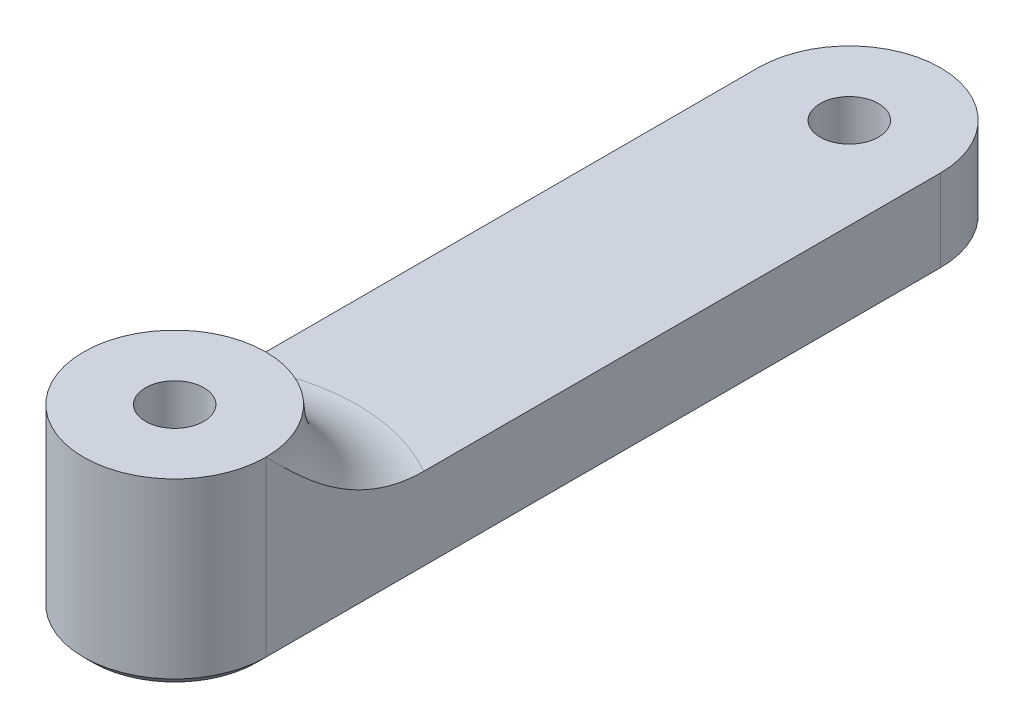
ISO-10303-21;
HEADER;
FILE_DESCRIPTION(('STEP AP214'),'2;1');
FILE_NAME('part.step','',(''),(''),'','','');
FILE_SCHEMA(('AUTOMOTIVE_DESIGN { 1 0 10303 214 1 1 1 1 }'));
ENDSEC;
DATA;
#1=APPLICATION_CONTEXT('core data for automotive mechanical design processes');
#2=APPLICATION_PROTOCOL_DEFINITION('international standard','automotive_design',2000,#1);
#3=PRODUCT_CONTEXT('',#1,'mechanical');
#4=PRODUCT('Part','Part','',(#3));
#5=PRODUCT_RELATED_PRODUCT_CATEGORY('part','',(#4));
#6=PRODUCT_DEFINITION_FORMATION('','',#4);
#7=PRODUCT_DEFINITION_CONTEXT('part definition',#1,'design');
#8=PRODUCT_DEFINITION('design','',#6,#7);
#9=PRODUCT_DEFINITION_SHAPE('','',#8);
#10=(LENGTH_UNIT() NAMED_UNIT(*) SI_UNIT(.MILLI.,.METRE.));
#11=(NAMED_UNIT(*) PLANE_ANGLE_UNIT() SI_UNIT($,.RADIAN.));
#12=(NAMED_UNIT(*) SI_UNIT($,.STERADIAN.) SOLID_ANGLE_UNIT());
#13=UNCERTAINTY_MEASURE_WITH_UNIT(LENGTH_MEASURE(1.E-05),#10,'distance_accuracy_value','');
#14=(GEOMETRIC_REPRESENTATION_CONTEXT(3) GLOBAL_UNCERTAINTY_ASSIGNED_CONTEXT((#13)) GLOBAL_UNIT_ASSIGNED_CONTEXT((#10,
#11,#12)) REPRESENTATION_CONTEXT('',''));
#15=CARTESIAN_POINT('',(0.,0.,0.));
#16=DIRECTION('',(0.,0.,1.));
#17=DIRECTION('',(1.,0.,0.));
#18=AXIS2_PLACEMENT_3D('',#15,#16,#17);
#19=CARTESIAN_POINT('',(5.,5.,0.));
#20=DIRECTION('',(-1.,0.,0.));
#21=DIRECTION('',(0.,0.,1.));
#22=AXIS2_PLACEMENT_3D('',#19,#20,#21);
#23=PLANE('',#22);
#24=DIRECTION('',(0.,-1.,0.));
#25=VECTOR('',#24,1.);
#26=CARTESIAN_POINT('',(5.,5.,0.));
#27=LINE('',#26,#25);
#28=CARTESIAN_POINT('',(5.,10.,0.));
#29=VERTEX_POINT('',#28);
#30=CARTESIAN_POINT('',(5.,0.499999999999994,0.));
#31=VERTEX_POINT('',#30);
#32=EDGE_CURVE('E132',#29,#31,#27,.T.);
#33=ORIENTED_EDGE('',*,*,#32,.T.);
#34=DIRECTION('',(0.,0.,-1.));
#35=VECTOR('',#34,1.);
#36=CARTESIAN_POINT('',(5.,0.499999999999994,0.));
#37=LINE('',#36,#35);
#38=CARTESIAN_POINT('',(5.,0.499999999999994,-37.));
#39=VERTEX_POINT('',#38);
#40=EDGE_CURVE('E131',#31,#39,#37,.T.);
#41=ORIENTED_EDGE('',*,*,#40,.T.);
#42=DIRECTION('',(0.,-1.,0.));
#43=VECTOR('',#42,1.);
#44=CARTESIAN_POINT('',(5.,5.,-37.));
#45=LINE('',#44,#43);
#46=CARTESIAN_POINT('',(5.,5.,-37.));
#47=VERTEX_POINT('',#46);
#48=EDGE_CURVE('E123',#47,#39,#45,.T.);
#49=ORIENTED_EDGE('',*,*,#48,.F.);
#50=DIRECTION('',(0.,0.,-1.));
#51=VECTOR('',#50,1.);
#52=CARTESIAN_POINT('',(5.,5.,0.));
#53=LINE('',#52,#51);
#54=CARTESIAN_POINT('',(5.,5.,-8.66025403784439));
#55=VERTEX_POINT('',#54);
#56=EDGE_CURVE('E109',#55,#47,#53,.T.);
#57=ORIENTED_EDGE('',*,*,#56,.F.);
#58=CARTESIAN_POINT('',(5.,5.,-8.66025403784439));
#59=CARTESIAN_POINT('',(5.,4.99997030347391,-8.44601573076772));
#60=CARTESIAN_POINT('',(5.,5.01032231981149,-8.23190253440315));
#61=CARTESIAN_POINT('',(5.,5.050367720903,-7.80580224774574));
#62=CARTESIAN_POINT('',(5.,5.08003167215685,-7.59381241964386));
#63=CARTESIAN_POINT('',(5.,5.15682193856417,-7.1757075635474));
#64=CARTESIAN_POINT('',(5.,5.20373357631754,-6.96955252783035));
#65=CARTESIAN_POINT('',(5.,5.31359736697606,-6.56149704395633));
#66=CARTESIAN_POINT('',(5.,5.37655718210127,-6.35959867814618));
#67=CARTESIAN_POINT('',(5.,5.54314037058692,-5.88676408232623));
#68=CARTESIAN_POINT('',(5.,5.65317829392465,-5.61808083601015));
#69=CARTESIAN_POINT('',(5.,5.89668641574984,-5.09159904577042));
#70=CARTESIAN_POINT('',(5.,6.03016371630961,-4.83380383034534));
#71=CARTESIAN_POINT('',(5.,6.31742397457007,-4.32824469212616));
#72=CARTESIAN_POINT('',(5.,6.47130085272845,-4.08053454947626));
#73=CARTESIAN_POINT('',(5.,6.7953125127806,-3.59591179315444));
#74=CARTESIAN_POINT('',(5.,6.96545472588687,-3.3590041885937));
#75=CARTESIAN_POINT('',(5.,7.56870777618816,-2.56650316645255));
#76=CARTESIAN_POINT('',(5.,8.03294068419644,-2.0348194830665));
#77=CARTESIAN_POINT('',(5.,8.99476039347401,-1.00542089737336));
#78=CARTESIAN_POINT('',(5.,9.49232114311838,-0.507680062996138));
#79=CARTESIAN_POINT('',(5.,9.99333333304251,-0.00666666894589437));
#80=CARTESIAN_POINT('',(5.,9.99666666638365,-0.00333333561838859));
#81=CARTESIAN_POINT('',(5.,10.,0.));
#82=B_SPLINE_CURVE_WITH_KNOTS('',3,(#58,#59,#60,#61,#62,#63,#64,#65,#66,#67,#68,#69,#70,#71,#72,
#73,#74,#75,#76,#77,#78,#79,#80,#81),.UNSPECIFIED.,.F.,.F.,(4,2,2,2,2,2,2,2,2,2,2,4),(0.,
0.642281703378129,1.28358678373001,1.91716595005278,2.55104818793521,3.42069998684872,
4.29061574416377,5.16468554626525,6.03915661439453,8.15226547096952,10.2637414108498,
10.2778835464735),.UNSPECIFIED.);
#83=EDGE_CURVE('E11',#55,#29,#82,.T.);
#84=ORIENTED_EDGE('',*,*,#83,.T.);
#85=EDGE_LOOP('',(#33,#41,#49,#57,#84));
#86=FACE_BOUND('',#85,.T.);
#87=ADVANCED_FACE('F47',(#86),#23,.F.);
#88=CARTESIAN_POINT('',(0.,5.,-37.));
#89=DIRECTION('',(0.,-1.,0.));
#90=DIRECTION('',(0.,0.,-1.));
#91=AXIS2_PLACEMENT_3D('',#88,#89,#90);
#92=CYLINDRICAL_SURFACE('',#91,5.);
#93=ORIENTED_EDGE('',*,*,#48,.T.);
#94=CARTESIAN_POINT('',(0.,0.499999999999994,-37.));
#95=DIRECTION('',(0.,1.,0.));
#96=DIRECTION('',(0.,0.,1.));
#97=AXIS2_PLACEMENT_3D('',#94,#95,#96);
#98=CIRCLE('',#97,5.);
#99=CARTESIAN_POINT('',(-5.,0.499999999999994,-37.));
#100=VERTEX_POINT('',#99);
#101=EDGE_CURVE('E157',#39,#100,#98,.T.);
#102=ORIENTED_EDGE('',*,*,#101,.T.);
#103=DIRECTION('',(0.,-1.,0.));
#104=VECTOR('',#103,1.);
#105=CARTESIAN_POINT('',(-5.,5.,-37.));
#106=LINE('',#105,#104);
#107=CARTESIAN_POINT('',(-5.,5.,-37.));
#108=VERTEX_POINT('',#107);
#109=EDGE_CURVE('E126',#108,#100,#106,.T.);
#110=ORIENTED_EDGE('',*,*,#109,.F.);
#111=CARTESIAN_POINT('',(0.,5.,-37.));
#112=DIRECTION('',(0.,1.,0.));
#113=DIRECTION('',(0.,0.,1.));
#114=AXIS2_PLACEMENT_3D('',#111,#112,#113);
#115=CIRCLE('',#114,5.);
#116=EDGE_CURVE('E112',#47,#108,#115,.T.);
#117=ORIENTED_EDGE('',*,*,#116,.F.);
#118=EDGE_LOOP('',(#93,#102,#110,#117));
#119=FACE_BOUND('',#118,.T.);
#120=ADVANCED_FACE('F121',(#119),#92,.T.);
#121=CARTESIAN_POINT('',(0.,5.,-37.));
#122=DIRECTION('',(0.,-1.,0.));
#123=DIRECTION('',(0.,0.,-1.));
#124=AXIS2_PLACEMENT_3D('',#121,#122,#123);
#125=CYLINDRICAL_SURFACE('',#124,1.6);
#126=CARTESIAN_POINT('',(0.,0.500000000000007,-37.));
#127=DIRECTION('',(0.,1.,0.));
#128=DIRECTION('',(0.,0.,1.));
#129=AXIS2_PLACEMENT_3D('',#126,#127,#128);
#130=CIRCLE('',#129,1.6);
#131=CARTESIAN_POINT('',(0.,0.500000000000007,-35.4));
#132=VERTEX_POINT('',#131);
#133=EDGE_CURVE('E164',#132,#132,#130,.F.);
#134=ORIENTED_EDGE('',*,*,#133,.T.);
#135=EDGE_LOOP('',(#134));
#136=FACE_BOUND('',#135,.T.);
#137=CARTESIAN_POINT('',(0.,5.,-37.));
#138=DIRECTION('',(0.,1.,0.));
#139=DIRECTION('',(0.,0.,1.));
#140=AXIS2_PLACEMENT_3D('',#137,#138,#139);
#141=CIRCLE('',#140,1.6);
#142=CARTESIAN_POINT('',(0.,5.,-35.4));
#143=VERTEX_POINT('',#142);
#144=EDGE_CURVE('E117',#143,#143,#141,.T.);
#145=ORIENTED_EDGE('',*,*,#144,.T.);
#146=EDGE_LOOP('',(#145));
#147=FACE_BOUND('',#146,.T.);
#148=ADVANCED_FACE('F188',(#136,#147),#125,.F.);
#149=CARTESIAN_POINT('',(-5.,5.,0.));
#150=DIRECTION('',(-1.,0.,0.));
#151=DIRECTION('',(0.,0.,1.));
#152=AXIS2_PLACEMENT_3D('',#149,#150,#151);
#153=PLANE('',#152);
#154=ORIENTED_EDGE('',*,*,#109,.T.);
#155=DIRECTION('',(0.,0.,1.));
#156=VECTOR('',#155,1.);
#157=CARTESIAN_POINT('',(-5.,0.499999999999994,0.));
#158=LINE('',#157,#156);
#159=CARTESIAN_POINT('',(-5.,0.499999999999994,0.));
#160=VERTEX_POINT('',#159);
#161=EDGE_CURVE('E159',#100,#160,#158,.T.);
#162=ORIENTED_EDGE('',*,*,#161,.T.);
#163=DIRECTION('',(0.,-1.,0.));
#164=VECTOR('',#163,1.);
#165=CARTESIAN_POINT('',(-5.,5.,0.));
#166=LINE('',#165,#164);
#167=CARTESIAN_POINT('',(-5.,10.,0.));
#168=VERTEX_POINT('',#167);
#169=EDGE_CURVE('E136',#168,#160,#166,.T.);
#170=ORIENTED_EDGE('',*,*,#169,.F.);
#171=CARTESIAN_POINT('',(-5.,5.,-8.66025403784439));
#172=CARTESIAN_POINT('',(-5.,4.99997030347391,-8.44601573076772));
#173=CARTESIAN_POINT('',(-5.,5.01032231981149,-8.23190253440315));
#174=CARTESIAN_POINT('',(-5.,5.050367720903,-7.80580224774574));
#175=CARTESIAN_POINT('',(-5.,5.08003167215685,-7.59381241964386));
#176=CARTESIAN_POINT('',(-5.,5.15682193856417,-7.1757075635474));
#177=CARTESIAN_POINT('',(-5.,5.20373357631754,-6.96955252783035));
#178=CARTESIAN_POINT('',(-5.,5.31359736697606,-6.56149704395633));
#179=CARTESIAN_POINT('',(-5.,5.37655718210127,-6.35959867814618));
#180=CARTESIAN_POINT('',(-5.,5.54314037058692,-5.88676408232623));
#181=CARTESIAN_POINT('',(-5.,5.65317829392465,-5.61808083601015));
#182=CARTESIAN_POINT('',(-5.,5.89668641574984,-5.09159904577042));
#183=CARTESIAN_POINT('',(-5.,6.03016371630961,-4.83380383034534));
#184=CARTESIAN_POINT('',(-5.,6.31742397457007,-4.32824469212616));
#185=CARTESIAN_POINT('',(-5.,6.47130085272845,-4.08053454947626));
#186=CARTESIAN_POINT('',(-5.,6.7953125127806,-3.59591179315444));
#187=CARTESIAN_POINT('',(-5.,6.96545472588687,-3.3590041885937));
#188=CARTESIAN_POINT('',(-5.,7.56870777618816,-2.56650316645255));
#189=CARTESIAN_POINT('',(-5.,8.03294068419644,-2.0348194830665));
#190=CARTESIAN_POINT('',(-5.,8.99476039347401,-1.00542089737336));
#191=CARTESIAN_POINT('',(-5.,9.49232114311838,-0.507680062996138));
#192=CARTESIAN_POINT('',(-5.,9.99333333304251,-0.00666666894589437));
#193=CARTESIAN_POINT('',(-5.,9.99666666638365,-0.00333333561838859));
#194=CARTESIAN_POINT('',(-5.,10.,0.));
#195=B_SPLINE_CURVE_WITH_KNOTS('',3,(#171,#172,#173,#174,#175,#176,#177,#178,#179,#180,#181,
#182,#183,#184,#185,#186,#187,#188,#189,#190,#191,#192,#193,#194),.UNSPECIFIED.,.F.,.F.,(4,2,2,
2,2,2,2,2,2,2,2,4),(0.,0.642281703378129,1.28358678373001,1.91716595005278,2.55104818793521,
3.42069998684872,4.29061574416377,5.16468554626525,6.03915661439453,8.15226547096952,
10.2637414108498,10.2778835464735),.UNSPECIFIED.);
#196=CARTESIAN_POINT('',(-5.,5.,-8.66025403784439));
#197=VERTEX_POINT('',#196);
#198=EDGE_CURVE('E61',#168,#197,#195,.F.);
#199=ORIENTED_EDGE('',*,*,#198,.T.);
#200=DIRECTION('',(0.,0.,-1.));
#201=VECTOR('',#200,1.);
#202=CARTESIAN_POINT('',(-5.,5.,0.));
#203=LINE('',#202,#201);
#204=EDGE_CURVE('E127',#197,#108,#203,.T.);
#205=ORIENTED_EDGE('',*,*,#204,.T.);
#206=EDGE_LOOP('',(#154,#162,#170,#199,#205));
#207=FACE_BOUND('',#206,.T.);
#208=ADVANCED_FACE('F183',(#207),#153,.T.);
#209=CARTESIAN_POINT('',(0.,5.,0.));
#210=DIRECTION('',(0.,1.,0.));
#211=DIRECTION('',(0.,0.,1.));
#212=AXIS2_PLACEMENT_3D('',#209,#210,#211);
#213=PLANE('',#212);
#214=ORIENTED_EDGE('',*,*,#144,.F.);
#215=EDGE_LOOP('',(#214));
#216=FACE_BOUND('',#215,.T.);
#217=ORIENTED_EDGE('',*,*,#204,.F.);
#218=CARTESIAN_POINT('',(0.,5.,0.));
#219=DIRECTION('',(0.,1.,0.));
#220=DIRECTION('',(0.,0.,1.));
#221=AXIS2_PLACEMENT_3D('',#218,#219,#220);
#222=CIRCLE('',#221,10.);
#223=EDGE_CURVE('E74',#197,#55,#222,.F.);
#224=ORIENTED_EDGE('',*,*,#223,.T.);
#225=ORIENTED_EDGE('',*,*,#56,.T.);
#226=ORIENTED_EDGE('',*,*,#116,.T.);
#227=EDGE_LOOP('',(#217,#224,#225,#226));
#228=FACE_BOUND('',#227,.T.);
#229=ADVANCED_FACE('F111',(#216,#228),#213,.T.);
#230=CARTESIAN_POINT('',(0.,0.,0.));
#231=DIRECTION('',(0.,1.,0.));
#232=DIRECTION('',(0.,0.,1.));
#233=AXIS2_PLACEMENT_3D('',#230,#231,#232);
#234=PLANE('',#233);
#235=CARTESIAN_POINT('',(0.,0.,0.));
#236=DIRECTION('',(0.,1.,0.));
#237=DIRECTION('',(0.,0.,1.));
#238=AXIS2_PLACEMENT_3D('',#235,#236,#237);
#239=CIRCLE('',#238,2.1);
#240=CARTESIAN_POINT('',(0.,0.,2.1));
#241=VERTEX_POINT('',#240);
#242=EDGE_CURVE('E151',#241,#241,#239,.T.);
#243=ORIENTED_EDGE('',*,*,#242,.T.);
#244=EDGE_LOOP('',(#243));
#245=FACE_BOUND('',#244,.T.);
#246=DIRECTION('',(0.,0.,-1.));
#247=VECTOR('',#246,1.);
#248=CARTESIAN_POINT('',(-4.5,0.,-37.));
#249=LINE('',#248,#247);
#250=CARTESIAN_POINT('',(-4.5,0.,0.));
#251=VERTEX_POINT('',#250);
#252=CARTESIAN_POINT('',(-4.5,0.,-37.));
#253=VERTEX_POINT('',#252);
#254=EDGE_CURVE('E146',#251,#253,#249,.T.);
#255=ORIENTED_EDGE('',*,*,#254,.T.);
#256=CARTESIAN_POINT('',(0.,0.,-37.));
#257=DIRECTION('',(0.,1.,0.));
#258=DIRECTION('',(0.,0.,1.));
#259=AXIS2_PLACEMENT_3D('',#256,#257,#258);
#260=CIRCLE('',#259,4.5);
#261=CARTESIAN_POINT('',(4.5,0.,-37.));
#262=VERTEX_POINT('',#261);
#263=EDGE_CURVE('E148',#253,#262,#260,.F.);
#264=ORIENTED_EDGE('',*,*,#263,.T.);
#265=DIRECTION('',(0.,0.,1.));
#266=VECTOR('',#265,1.);
#267=CARTESIAN_POINT('',(4.5,0.,0.));
#268=LINE('',#267,#266);
#269=CARTESIAN_POINT('',(4.5,0.,0.));
#270=VERTEX_POINT('',#269);
#271=EDGE_CURVE('E142',#262,#270,#268,.T.);
#272=ORIENTED_EDGE('',*,*,#271,.T.);
#273=CARTESIAN_POINT('',(0.,0.,0.));
#274=DIRECTION('',(0.,1.,0.));
#275=DIRECTION('',(0.,0.,1.));
#276=AXIS2_PLACEMENT_3D('',#273,#274,#275);
#277=CIRCLE('',#276,4.5);
#278=EDGE_CURVE('E144',#270,#251,#277,.F.);
#279=ORIENTED_EDGE('',*,*,#278,.T.);
#280=EDGE_LOOP('',(#255,#264,#272,#279));
#281=FACE_BOUND('',#280,.T.);
#282=CARTESIAN_POINT('',(0.,0.,-37.));
#283=DIRECTION('',(0.,1.,0.));
#284=DIRECTION('',(0.,0.,1.));
#285=AXIS2_PLACEMENT_3D('',#282,#283,#284);
#286=CIRCLE('',#285,2.1);
#287=CARTESIAN_POINT('',(0.,0.,-34.9));
#288=VERTEX_POINT('',#287);
#289=EDGE_CURVE('E134',#288,#288,#286,.T.);
#290=ORIENTED_EDGE('',*,*,#289,.T.);
#291=EDGE_LOOP('',(#290));
#292=FACE_BOUND('',#291,.T.);
#293=ADVANCED_FACE('F189',(#245,#281,#292),#234,.F.);
#294=CARTESIAN_POINT('',(0.,10.,0.));
#295=DIRECTION('',(0.,-1.,0.));
#296=DIRECTION('',(0.,0.,-1.));
#297=AXIS2_PLACEMENT_3D('',#294,#295,#296);
#298=CYLINDRICAL_SURFACE('',#297,5.);
#299=CARTESIAN_POINT('',(0.,10.,0.));
#300=DIRECTION('',(0.,1.,0.));
#301=DIRECTION('',(0.,0.,1.));
#302=AXIS2_PLACEMENT_3D('',#299,#300,#301);
#303=CIRCLE('',#302,5.);
#304=EDGE_CURVE('E177',#168,#29,#303,.T.);
#305=ORIENTED_EDGE('',*,*,#304,.F.);
#306=ORIENTED_EDGE('',*,*,#169,.T.);
#307=CARTESIAN_POINT('',(0.,0.499999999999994,0.));
#308=DIRECTION('',(0.,1.,0.));
#309=DIRECTION('',(0.,0.,1.));
#310=AXIS2_PLACEMENT_3D('',#307,#308,#309);
#311=CIRCLE('',#310,5.);
#312=EDGE_CURVE('E161',#160,#31,#311,.T.);
#313=ORIENTED_EDGE('',*,*,#312,.T.);
#314=ORIENTED_EDGE('',*,*,#32,.F.);
#315=EDGE_LOOP('',(#305,#306,#313,#314));
#316=FACE_BOUND('',#315,.T.);
#317=ADVANCED_FACE('F248',(#316),#298,.T.);
#318=CARTESIAN_POINT('',(0.,10.,0.));
#319=DIRECTION('',(0.,-1.,0.));
#320=DIRECTION('',(0.,0.,-1.));
#321=AXIS2_PLACEMENT_3D('',#318,#319,#320);
#322=CYLINDRICAL_SURFACE('',#321,1.6);
#323=CARTESIAN_POINT('',(0.,0.500000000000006,0.));
#324=DIRECTION('',(0.,1.,0.));
#325=DIRECTION('',(0.,0.,1.));
#326=AXIS2_PLACEMENT_3D('',#323,#324,#325);
#327=CIRCLE('',#326,1.6);
#328=CARTESIAN_POINT('',(0.,0.500000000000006,1.6));
#329=VERTEX_POINT('',#328);
#330=EDGE_CURVE('E154',#329,#329,#327,.F.);
#331=ORIENTED_EDGE('',*,*,#330,.T.);
#332=EDGE_LOOP('',(#331));
#333=FACE_BOUND('',#332,.T.);
#334=CARTESIAN_POINT('',(0.,10.,0.));
#335=DIRECTION('',(0.,1.,0.));
#336=DIRECTION('',(0.,0.,1.));
#337=AXIS2_PLACEMENT_3D('',#334,#335,#336);
#338=CIRCLE('',#337,1.6);
#339=CARTESIAN_POINT('',(0.,10.,1.6));
#340=VERTEX_POINT('',#339);
#341=EDGE_CURVE('E274',#340,#340,#338,.T.);
#342=ORIENTED_EDGE('',*,*,#341,.T.);
#343=EDGE_LOOP('',(#342));
#344=FACE_BOUND('',#343,.T.);
#345=ADVANCED_FACE('F254',(#333,#344),#322,.F.);
#346=CARTESIAN_POINT('',(0.,10.,0.));
#347=DIRECTION('',(0.,1.,0.));
#348=DIRECTION('',(0.,0.,1.));
#349=AXIS2_PLACEMENT_3D('',#346,#347,#348);
#350=PLANE('',#349);
#351=EDGE_CURVE('E277',#29,#168,#303,.T.);
#352=ORIENTED_EDGE('',*,*,#351,.T.);
#353=ORIENTED_EDGE('',*,*,#304,.T.);
#354=EDGE_LOOP('',(#352,#353));
#355=FACE_BOUND('',#354,.T.);
#356=ORIENTED_EDGE('',*,*,#341,.F.);
#357=EDGE_LOOP('',(#356));
#358=FACE_BOUND('',#357,.T.);
#359=ADVANCED_FACE('F206',(#355,#358),#350,.T.);
#360=CARTESIAN_POINT('',(0.,0.,0.));
#361=DIRECTION('',(0.,-1.,0.));
#362=DIRECTION('',(0.,0.,-1.));
#363=AXIS2_PLACEMENT_3D('',#360,#361,#362);
#364=CONICAL_SURFACE('',#363,2.1,0.78539816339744);
#365=ORIENTED_EDGE('',*,*,#330,.F.);
#366=EDGE_LOOP('',(#365));
#367=FACE_BOUND('',#366,.T.);
#368=ORIENTED_EDGE('',*,*,#242,.F.);
#369=EDGE_LOOP('',(#368));
#370=FACE_BOUND('',#369,.T.);
#371=ADVANCED_FACE('F199',(#367,#370),#364,.F.);
#372=CARTESIAN_POINT('',(0.,0.499999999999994,0.));
#373=DIRECTION('',(0.,1.,0.));
#374=DIRECTION('',(0.,0.,1.));
#375=AXIS2_PLACEMENT_3D('',#372,#373,#374);
#376=CONICAL_SURFACE('',#375,5.,0.785398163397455);
#377=DIRECTION('',(-0.707106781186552,0.707106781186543,0.));
#378=VECTOR('',#377,1.);
#379=CARTESIAN_POINT('',(-4.5,0.,0.));
#380=LINE('',#379,#378);
#381=EDGE_CURVE('E171',#251,#160,#380,.T.);
#382=ORIENTED_EDGE('',*,*,#381,.F.);
#383=ORIENTED_EDGE('',*,*,#278,.F.);
#384=DIRECTION('',(-0.707106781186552,-0.707106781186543,0.));
#385=VECTOR('',#384,1.);
#386=CARTESIAN_POINT('',(5.,0.499999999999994,0.));
#387=LINE('',#386,#385);
#388=EDGE_CURVE('E174',#31,#270,#387,.T.);
#389=ORIENTED_EDGE('',*,*,#388,.F.);
#390=ORIENTED_EDGE('',*,*,#312,.F.);
#391=EDGE_LOOP('',(#382,#383,#389,#390));
#392=FACE_BOUND('',#391,.T.);
#393=ADVANCED_FACE('F205',(#392),#376,.T.);
#394=CARTESIAN_POINT('',(5.,0.499999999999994,0.));
#395=DIRECTION('',(-0.707106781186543,0.707106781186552,0.));
#396=DIRECTION('',(0.,0.,-1.));
#397=AXIS2_PLACEMENT_3D('',#394,#395,#396);
#398=PLANE('',#397);
#399=ORIENTED_EDGE('',*,*,#388,.T.);
#400=ORIENTED_EDGE('',*,*,#271,.F.);
#401=DIRECTION('',(-0.707106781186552,-0.707106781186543,0.));
#402=VECTOR('',#401,1.);
#403=CARTESIAN_POINT('',(5.,0.499999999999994,-37.));
#404=LINE('',#403,#402);
#405=EDGE_CURVE('E169',#39,#262,#404,.T.);
#406=ORIENTED_EDGE('',*,*,#405,.F.);
#407=ORIENTED_EDGE('',*,*,#40,.F.);
#408=EDGE_LOOP('',(#399,#400,#406,#407));
#409=FACE_BOUND('',#408,.T.);
#410=ADVANCED_FACE('F224',(#409),#398,.F.);
#411=CARTESIAN_POINT('',(-4.5,0.,0.));
#412=DIRECTION('',(-0.707106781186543,-0.707106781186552,0.));
#413=DIRECTION('',(0.,0.,1.));
#414=AXIS2_PLACEMENT_3D('',#411,#412,#413);
#415=PLANE('',#414);
#416=ORIENTED_EDGE('',*,*,#381,.T.);
#417=ORIENTED_EDGE('',*,*,#161,.F.);
#418=DIRECTION('',(-0.707106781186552,0.707106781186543,0.));
#419=VECTOR('',#418,1.);
#420=CARTESIAN_POINT('',(-4.5,0.,-37.));
#421=LINE('',#420,#419);
#422=EDGE_CURVE('E167',#253,#100,#421,.T.);
#423=ORIENTED_EDGE('',*,*,#422,.F.);
#424=ORIENTED_EDGE('',*,*,#254,.F.);
#425=EDGE_LOOP('',(#416,#417,#423,#424));
#426=FACE_BOUND('',#425,.T.);
#427=ADVANCED_FACE('F217',(#426),#415,.T.);
#428=CARTESIAN_POINT('',(0.,0.499999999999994,-37.));
#429=DIRECTION('',(0.,1.,0.));
#430=DIRECTION('',(0.,0.,1.));
#431=AXIS2_PLACEMENT_3D('',#428,#429,#430);
#432=CONICAL_SURFACE('',#431,5.,0.785398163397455);
#433=ORIENTED_EDGE('',*,*,#405,.T.);
#434=ORIENTED_EDGE('',*,*,#263,.F.);
#435=ORIENTED_EDGE('',*,*,#422,.T.);
#436=ORIENTED_EDGE('',*,*,#101,.F.);
#437=EDGE_LOOP('',(#433,#434,#435,#436));
#438=FACE_BOUND('',#437,.T.);
#439=ADVANCED_FACE('F209',(#438),#432,.T.);
#440=CARTESIAN_POINT('',(0.,0.,-37.));
#441=DIRECTION('',(0.,-1.,0.));
#442=DIRECTION('',(0.,0.,-1.));
#443=AXIS2_PLACEMENT_3D('',#440,#441,#442);
#444=CONICAL_SURFACE('',#443,2.1,0.78539816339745);
#445=ORIENTED_EDGE('',*,*,#133,.F.);
#446=EDGE_LOOP('',(#445));
#447=FACE_BOUND('',#446,.T.);
#448=ORIENTED_EDGE('',*,*,#289,.F.);
#449=EDGE_LOOP('',(#448));
#450=FACE_BOUND('',#449,.T.);
#451=ADVANCED_FACE('F216',(#447,#450),#444,.F.);
#452=CARTESIAN_POINT('',(0.,10.,0.));
#453=DIRECTION('',(0.,1.,0.));
#454=DIRECTION('',(0.,0.,1.));
#455=AXIS2_PLACEMENT_3D('',#452,#453,#454);
#456=TOROIDAL_SURFACE('',#455,10.,5.);
#457=ORIENTED_EDGE('',*,*,#83,.F.);
#458=ORIENTED_EDGE('',*,*,#223,.F.);
#459=ORIENTED_EDGE('',*,*,#198,.F.);
#460=ORIENTED_EDGE('',*,*,#351,.F.);
#461=EDGE_LOOP('',(#457,#458,#459,#460));
#462=FACE_BOUND('',#461,.T.);
#463=ADVANCED_FACE('F49',(#462),#456,.F.);
#464=CLOSED_SHELL('',(#87,#120,#148,#208,#229,#293,#317,#345,#359,#371,#393,#410,#427,#439,#451,#463));
#465=MANIFOLD_SOLID_BREP('B2',#464);
#466=ADVANCED_BREP_SHAPE_REPRESENTATION('',(#18,#465),#14);
#467=SHAPE_DEFINITION_REPRESENTATION(#9,#466);
ENDSEC;
END-ISO-10303-21;
